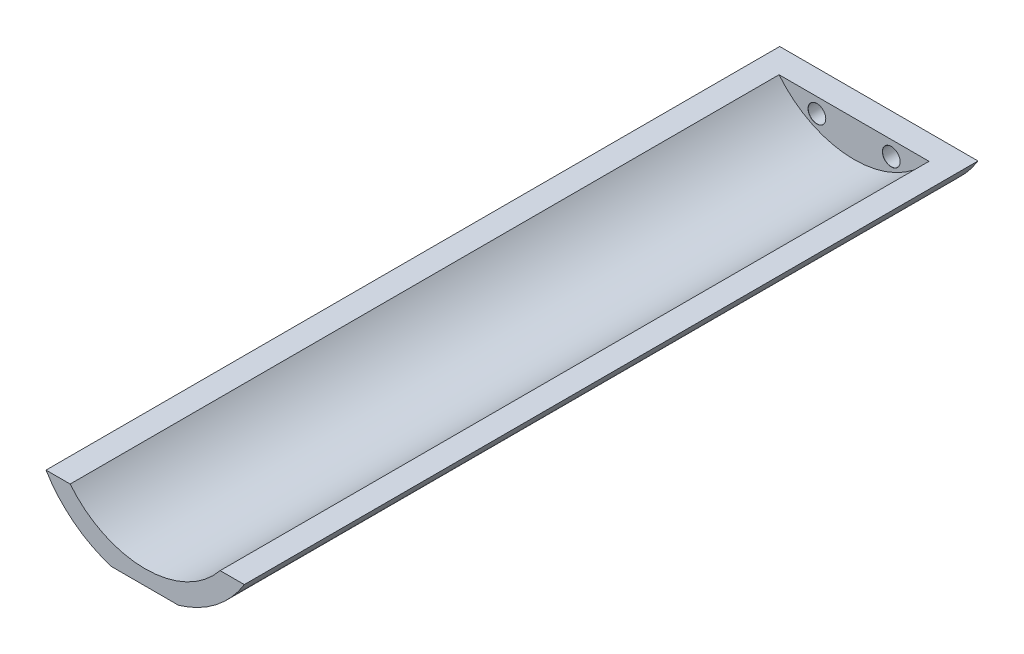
from build123d import *

# Parameters (mm, degrees)
BOSS_EXTRUDE1_DEPTH             = 457.2
PIXHAWK_PLATFORM_REACH          = 460.128
SKETCH3_W                       = 50.8
SKETCH3_H                       = 81.28
BOSS_EXTRUDE3_REACH             = 460.128
BOSS_EXTRUDE3_END_RADIUS        = 24.638
BOSS_EXTRUDE3_DIRECTION_2_DEPTH = 12.7
BOSS_EXTRUDE4_REACH             = 460.128
SKETCH6_W                       = 50.8
SKETCH6_H                       = 6.35
CUT_EXTRUDE2_DEPTH              = 459.69979452
CUT_EXTRUDE3_DEPTH              = 459.127958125
CUT_EXTRUDE3_DEPTH_BACK         = 459.127958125
SKETCH8_W                       = 177.8
SKETCH8_H                       = 279.4
BOSS_EXTRUDE5_START             = -6.35
BOSS_EXTRUDE5_DEPTH             = 6.35
M4_CLEARANCE_HOLE_D             = 4.5
M4_CLEARANCE_HOLE_CSINK_D       = 4.55
M4_CLEARANCE_HOLE_CSINK_ANGLE   = 90
SKETCH12_W                      = 45.639023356
SKETCH12_H                      = 5.916169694
CUT_EXTRUDE4_DEPTH              = 192.98250213


with BuildPart() as part:
    # Sketch2 → Boss-Extrude1 (new body)
    with BuildSketch(Plane.XY):
        with BuildLine():
            Line((-19.210193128, -15.427233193), (-25.4, -15.427233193))
            ThreePointArc((-25.4, -15.427233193), (0, -29.718), (25.4, -15.427233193))
            Line((25.4, -15.427233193), (19.210193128, -15.427233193))
            ThreePointArc((19.210193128, -15.427233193), (0, -24.638), (-19.210193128, -15.427233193))
        make_face()
    extrude(amount=-BOSS_EXTRUDE1_DEPTH)

    # Sketch3 → Pixhawk Platform (add, up to next)
    with BuildSketch(Plane(origin=(0, -15.427233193, 0), x_dir=(1, 0, 0), z_dir=(0, 1, 0)), mode=Mode.PRIVATE) as pixhawk_platform_sk1:
        with Locations((0, 228.6)):
            Rectangle(SKETCH3_W, SKETCH3_H)
    pixhawk_platform_tool1 = extrude(pixhawk_platform_sk1.sketch, amount=-PIXHAWK_PLATFORM_REACH, mode=Mode.PRIVATE) - part.part
    add(pixhawk_platform_tool1.solids().sort_by_distance((0, -15.427233, -228.6))[0])

    # Boss-Extrude3: up to this cylinder (the profile starts inside it)
    boss_extrude3_end = Plane(origin=(0, 0, -398.446365), z_dir=(0, 0, 1)) * Cylinder(BOSS_EXTRUDE3_END_RADIUS, 970.532, mode=Mode.PRIVATE)
    # Sketch5 → Boss-Extrude3 (add, up to the surface)
    with BuildSketch(Plane(origin=(0, -15.427233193, 0), x_dir=(1, 0, 0), z_dir=(0, 1, 0)), mode=Mode.PRIVATE) as boss_extrude3_sk1:
        Polygon((-17.018, 397.51), (17.018, 397.51), (17.018, 320.04), (22.098, 320.04), (22.098, 402.59), (-22.098, 402.59), (-22.098, 320.04), (-17.018, 320.04), align=None)
    boss_extrude3_tool1 = extrude(boss_extrude3_sk1.sketch, amount=-BOSS_EXTRUDE3_REACH, mode=Mode.PRIVATE) & boss_extrude3_end
    add(boss_extrude3_tool1.solids().sort_by_distance((0, -15.427233, -398.446365))[0])

    # Sketch5 → Boss-Extrude3 direction 2 (add)
    with BuildSketch(Plane(origin=(0, -15.427233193, 0), x_dir=(1, 0, 0), z_dir=(0, 1, 0))):
        Polygon((-17.018, 397.51), (17.018, 397.51), (17.018, 320.04), (22.098, 320.04), (22.098, 402.59), (-22.098, 402.59), (-22.098, 320.04), (-17.018, 320.04), align=None)
    extrude(amount=BOSS_EXTRUDE3_DIRECTION_2_DEPTH)

    # Sketch6 → Boss-Extrude4 (add, up to next)
    with BuildSketch(Plane(origin=(0, -15.427233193, 0), x_dir=(1, 0, 0), z_dir=(0, 1, 0)), mode=Mode.PRIVATE) as boss_extrude4_sk1:
        with Locations((0, 454.025)):
            Rectangle(SKETCH6_W, SKETCH6_H)
    boss_extrude4_tool1 = extrude(boss_extrude4_sk1.sketch, amount=-BOSS_EXTRUDE4_REACH, mode=Mode.PRIVATE) - part.part
    add(boss_extrude4_tool1.solids().sort_by_distance((0, -15.427233, -454.025))[0])

    # Sketch7 → Cut-Extrude2 (cut, through all)
    with BuildSketch(Plane(origin=(0, -2.727233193, 0), x_dir=(1, 0, 0), z_dir=(0, 1, 0))):
        Polygon((-17.018, 397.51), (17.018, 397.51), (17.018, 320.04), (12.7, 307.34), (-12.7, 307.34), (-17.018, 320.04), align=None)
    extrude(amount=-CUT_EXTRUDE2_DEPTH, mode=Mode.SUBTRACT)

    # Sketch8 → Cut-Extrude3 (cut, two sides: drawn at the far end of the back side and taken through both)
    with BuildSketch(Plane(origin=(0, -15.427233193, 0), x_dir=(1, 0, 0), z_dir=(0, 1, 0)).offset(-CUT_EXTRUDE3_DEPTH_BACK)):
        with Locations((0, 327.66)):
            Rectangle(SKETCH8_W, SKETCH8_H)
    extrude(amount=CUT_EXTRUDE3_DEPTH + CUT_EXTRUDE3_DEPTH_BACK, mode=Mode.SUBTRACT)

    # Sketch9 → Boss-Extrude5 (add)
    with BuildSketch(Plane(origin=(0, 0, -187.96), x_dir=(-1, 0, 0), z_dir=(0, 0, -1)).offset(BOSS_EXTRUDE5_START)):
        with BuildLine():
            Line((19.210193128, -15.427233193), (-19.210193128, -15.427233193))
            ThreePointArc((-19.210193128, -15.427233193), (0, -24.638), (19.210193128, -15.427233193))
        make_face()
    extrude(amount=BOSS_EXTRUDE5_DEPTH)

    # M4 Clearance Hole (through all)
    with Locations(Plane(origin=(-641.86826576, -879.841250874, -181.61), x_dir=(1, 0, 0), z_dir=(0, 0, 1))):
        with Locations((651.39326576, 860.604017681), (632.34326576, 860.604017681)):
            CounterSinkHole(M4_CLEARANCE_HOLE_D / 2, M4_CLEARANCE_HOLE_CSINK_D / 2, counter_sink_angle=M4_CLEARANCE_HOLE_CSINK_ANGLE)

    # Sketch12 → Cut-Extrude4 (cut, through all)
    with BuildSketch(Plane.XY):
        with Locations((0, -31.406084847)):
            Rectangle(SKETCH12_W, SKETCH12_H)
    extrude(amount=-CUT_EXTRUDE4_DEPTH, mode=Mode.SUBTRACT)


solid = part.part
